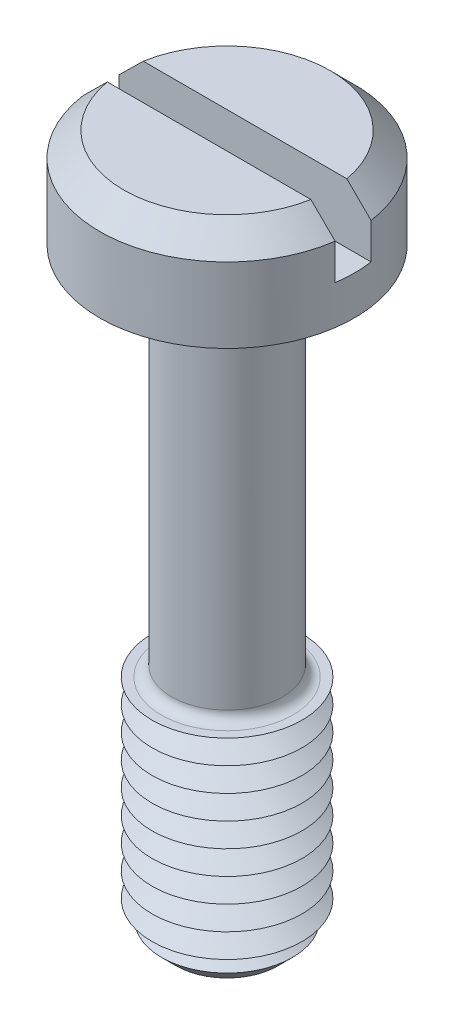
from build123d import *

# Parameters (mm, degrees)
SKETCH1_R           = 4.25
BOSS_EXTRUDE1_DEPTH = 3.3
SKETCH2_R           = 1.85
BOSS_EXTRUDE2_DEPTH = 20
SKETCH3_R           = 2.5
BOSS_EXTRUDE3_DEPTH = 7.5
CHAMFER1_SIZE       = 0.8
LPATTERN1_COUNT     = 9
LPATTERN1_PITCH     = 0.8
FILLET1_R           = 0.35
CHAMFER2_SIZE       = 0.8
SKETCH6_W           = 8.5
SKETCH6_H           = 1.2
CUT_EXTRUDE1_DEPTH  = 2


with BuildPart() as part:
    # Sketch1 → Boss-Extrude1 (new body)
    with BuildSketch(Plane(origin=(0, 0, 0), x_dir=(1, 0, 0), z_dir=(0, 1, 0))):
        with Locations(Location((0, 0, 0), (0, 0, 270))):
            Circle(SKETCH1_R)
    extrude(amount=BOSS_EXTRUDE1_DEPTH)

    # Sketch2 → Boss-Extrude2 (add)
    with BuildSketch(Plane.XZ):
        with Locations(Location((0, 0, 0), (0, 0, 270))):
            Circle(SKETCH2_R)
    extrude(amount=BOSS_EXTRUDE2_DEPTH)

    # Sketch3 → Boss-Extrude3 (add)
    with BuildSketch(Plane.XZ.offset(20)):
        with Locations(Location((0, 0, 0), (0, 0, 270))):
            Circle(SKETCH3_R)
    extrude(amount=-BOSS_EXTRUDE3_DEPTH)

    # Chamfer1
    chamfer1_edges = [part.edges().sort_by_distance(p)[0] for p in [
        (0, -20, 2.5),
    ]]
    chamfer(chamfer1_edges, length=CHAMFER1_SIZE)

    # Sketch5 → Cut-Revolve1 (revolve, cut)
    with BuildSketch(Plane(origin=(0, 0, 0), x_dir=(0, 0, -1), z_dir=(1, 0, 0))):
        Polygon((-2.5, -12.5), (-1.807179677, -12.9), (-2.5, -13.3), align=None)
    cut_revolve1 = revolve(axis=Axis((0, -6.58711856, 0), (0, -1, 0)), mode=Mode.SUBTRACT)

    # LPattern1: Cut-Revolve1 ×9
    with Locations(*[(0, -i * LPATTERN1_PITCH, 0) for i in range(1, LPATTERN1_COUNT)]):
        add(cut_revolve1, mode=Mode.SUBTRACT)

    # Fillet1
    fillet1_edges = [part.edges().sort_by_distance(p)[0] for p in [
        (0, 0, 1.85),
        (0, -12.5, 1.85),
    ]]
    fillet(fillet1_edges, radius=FILLET1_R)

    # Chamfer2
    chamfer2_edges = [part.edges().sort_by_distance(p)[0] for p in [
        (0, 3.3, -4.25),
    ]]
    chamfer(chamfer2_edges, length=CHAMFER2_SIZE)

    # Sketch6 → Cut-Extrude1 (cut)
    with BuildSketch(Plane(origin=(0, 3.3, 0), x_dir=(1, 0, 0), z_dir=(0, 1, 0))):
        Rectangle(SKETCH6_W, SKETCH6_H)
    extrude(amount=-CUT_EXTRUDE1_DEPTH, mode=Mode.SUBTRACT)


solid = part.part
